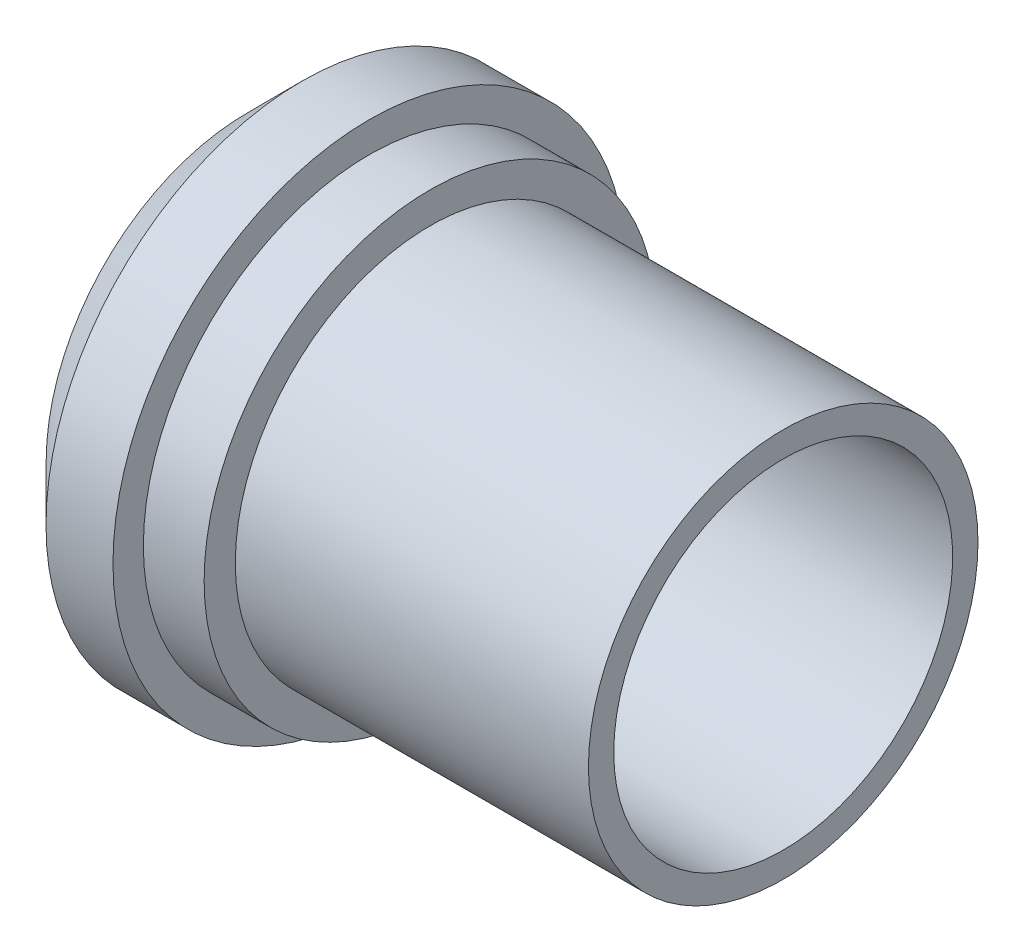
from build123d import *

# Parameters (mm, degrees)
SKETCH4_R          = 11.049
CUT_EXTRUDE1_DEPTH = 34.925


with BuildPart() as part:
    # Sketch1 → Revolve1 (revolve)
    with BuildSketch(Plane.XY, mode=Mode.PRIVATE) as revolve1_sk:
        Polygon((0, 0), (-23.0251, 0), (-23.0251, -2.032), (-26.9875, -2.032), (-26.9875, -4.0132), (-31.35376, -4.0132), (-34.925, -0.4318), (-34.925, 12.7), (0, 12.7), align=None)
    revolve(revolve1_sk.sketch.rotate(Axis((-34.925, 12.7, 0), (1, 0, 0)), 270), axis=Axis((-34.925, 12.7, 0), (1, 0, 0)))

    # Sketch4 → Cut-Extrude1 (cut)
    with BuildSketch(Plane.ZY.offset(34.925)):
        with Locations((0, 12.7)):
            Circle(SKETCH4_R)
    extrude(amount=-CUT_EXTRUDE1_DEPTH, mode=Mode.SUBTRACT)


solid = part.part
